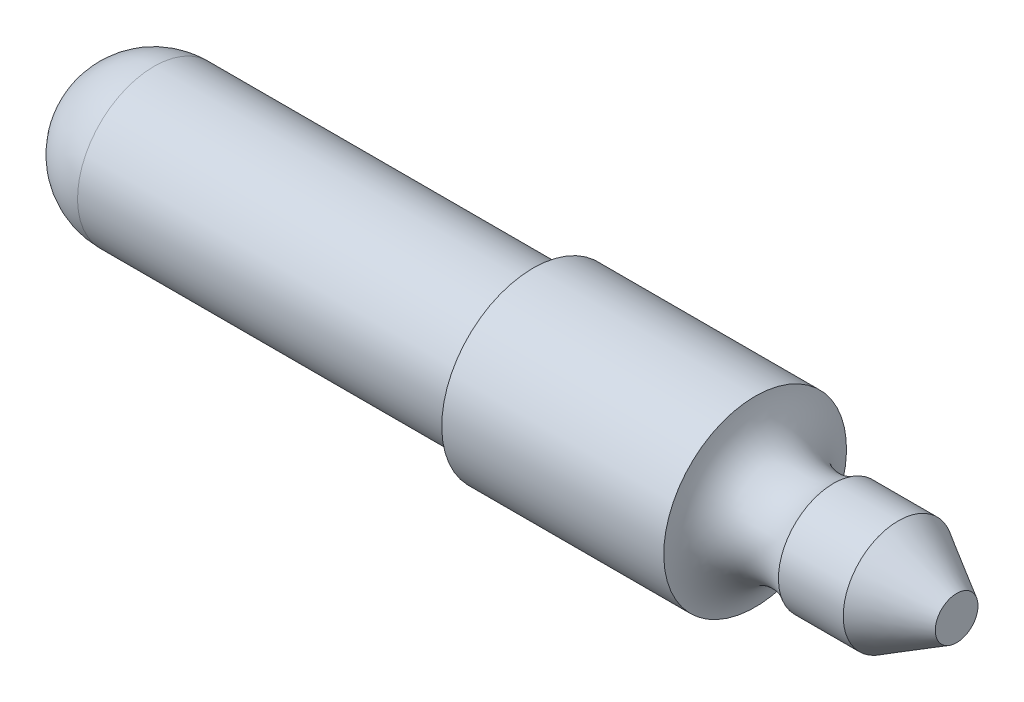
ISO-10303-21;
HEADER;
FILE_DESCRIPTION(('STEP AP214'),'2;1');
FILE_NAME('part.step','',(''),(''),'','','');
FILE_SCHEMA(('AUTOMOTIVE_DESIGN { 1 0 10303 214 1 1 1 1 }'));
ENDSEC;
DATA;
#1=APPLICATION_CONTEXT('core data for automotive mechanical design processes');
#2=APPLICATION_PROTOCOL_DEFINITION('international standard','automotive_design',2000,#1);
#3=PRODUCT_CONTEXT('',#1,'mechanical');
#4=PRODUCT('Part','Part','',(#3));
#5=PRODUCT_RELATED_PRODUCT_CATEGORY('part','',(#4));
#6=PRODUCT_DEFINITION_FORMATION('','',#4);
#7=PRODUCT_DEFINITION_CONTEXT('part definition',#1,'design');
#8=PRODUCT_DEFINITION('design','',#6,#7);
#9=PRODUCT_DEFINITION_SHAPE('','',#8);
#10=(LENGTH_UNIT() NAMED_UNIT(*) SI_UNIT(.MILLI.,.METRE.));
#11=(NAMED_UNIT(*) PLANE_ANGLE_UNIT() SI_UNIT($,.RADIAN.));
#12=(NAMED_UNIT(*) SI_UNIT($,.STERADIAN.) SOLID_ANGLE_UNIT());
#13=UNCERTAINTY_MEASURE_WITH_UNIT(LENGTH_MEASURE(1.E-05),#10,'distance_accuracy_value','');
#14=(GEOMETRIC_REPRESENTATION_CONTEXT(3) GLOBAL_UNCERTAINTY_ASSIGNED_CONTEXT((#13)) GLOBAL_UNIT_ASSIGNED_CONTEXT((#10,
#11,#12)) REPRESENTATION_CONTEXT('',''));
#15=CARTESIAN_POINT('',(0.,0.,0.));
#16=DIRECTION('',(0.,0.,1.));
#17=DIRECTION('',(1.,0.,0.));
#18=AXIS2_PLACEMENT_3D('',#15,#16,#17);
#19=CARTESIAN_POINT('',(0.,0.,0.));
#20=DIRECTION('',(1.,0.,0.));
#21=DIRECTION('',(0.,1.,0.));
#22=AXIS2_PLACEMENT_3D('',#19,#20,#21);
#23=PLANE('',#22);
#24=CARTESIAN_POINT('',(0.,0.,0.));
#25=DIRECTION('',(1.,0.,0.));
#26=DIRECTION('',(0.,1.,0.));
#27=AXIS2_PLACEMENT_3D('',#24,#25,#26);
#28=CIRCLE('',#27,0.318);
#29=CARTESIAN_POINT('',(0.,0.318,0.));
#30=VERTEX_POINT('',#29);
#31=EDGE_CURVE('E10',#30,#30,#28,.T.);
#32=ORIENTED_EDGE('',*,*,#31,.T.);
#33=EDGE_LOOP('',(#32));
#34=FACE_BOUND('',#33,.T.);
#35=ADVANCED_FACE('F28',(#34),#23,.T.);
#36=CARTESIAN_POINT('',(0.,0.,0.));
#37=DIRECTION('',(-1.,0.,0.));
#38=DIRECTION('',(0.,-1.,0.));
#39=AXIS2_PLACEMENT_3D('',#36,#37,#38);
#40=CONICAL_SURFACE('',#39,0.318,0.5235987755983);
#41=CARTESIAN_POINT('',(-0.867757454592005,0.,0.));
#42=DIRECTION('',(1.,0.,0.));
#43=DIRECTION('',(0.,1.,0.));
#44=AXIS2_PLACEMENT_3D('',#41,#42,#43);
#45=CIRCLE('',#44,0.819);
#46=CARTESIAN_POINT('',(-0.867757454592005,0.819,0.));
#47=VERTEX_POINT('',#46);
#48=EDGE_CURVE('E34',#47,#47,#45,.T.);
#49=ORIENTED_EDGE('',*,*,#48,.T.);
#50=EDGE_LOOP('',(#49));
#51=FACE_BOUND('',#50,.T.);
#52=ORIENTED_EDGE('',*,*,#31,.F.);
#53=EDGE_LOOP('',(#52));
#54=FACE_BOUND('',#53,.T.);
#55=ADVANCED_FACE('F69',(#51,#54),#40,.T.);
#56=CARTESIAN_POINT('',(0.,0.,0.));
#57=DIRECTION('',(1.,0.,0.));
#58=DIRECTION('',(0.,1.,0.));
#59=AXIS2_PLACEMENT_3D('',#56,#57,#58);
#60=CYLINDRICAL_SURFACE('',#59,0.819);
#61=CARTESIAN_POINT('',(-1.8313944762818,0.,0.));
#62=DIRECTION('',(1.,0.,0.));
#63=DIRECTION('',(0.,1.,0.));
#64=AXIS2_PLACEMENT_3D('',#61,#62,#63);
#65=CIRCLE('',#64,0.819);
#66=CARTESIAN_POINT('',(-1.8313944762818,0.818999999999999,0.));
#67=VERTEX_POINT('',#66);
#68=EDGE_CURVE('E38',#67,#67,#65,.T.);
#69=ORIENTED_EDGE('',*,*,#68,.T.);
#70=EDGE_LOOP('',(#69));
#71=FACE_BOUND('',#70,.T.);
#72=ORIENTED_EDGE('',*,*,#48,.F.);
#73=EDGE_LOOP('',(#72));
#74=FACE_BOUND('',#73,.T.);
#75=ADVANCED_FACE('F73',(#71,#74),#60,.T.);
#76=CARTESIAN_POINT('',(-2.24185762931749,0.,0.));
#77=DIRECTION('',(1.,0.,0.));
#78=DIRECTION('',(0.,1.,0.));
#79=AXIS2_PLACEMENT_3D('',#76,#77,#78);
#80=TOROIDAL_SURFACE('',#79,1.461,0.762);
#81=CARTESIAN_POINT('',(-2.997,0.,0.));
#82=DIRECTION('',(1.,0.,0.));
#83=DIRECTION('',(0.,1.,0.));
#84=AXIS2_PLACEMENT_3D('',#81,#82,#83);
#85=CIRCLE('',#84,1.359);
#86=CARTESIAN_POINT('',(-2.997,1.359,0.));
#87=VERTEX_POINT('',#86);
#88=EDGE_CURVE('E42',#87,#87,#85,.T.);
#89=ORIENTED_EDGE('',*,*,#88,.T.);
#90=EDGE_LOOP('',(#89));
#91=FACE_BOUND('',#90,.T.);
#92=ORIENTED_EDGE('',*,*,#68,.F.);
#93=EDGE_LOOP('',(#92));
#94=FACE_BOUND('',#93,.T.);
#95=ADVANCED_FACE('F77',(#91,#94),#80,.F.);
#96=CARTESIAN_POINT('',(0.,0.,0.));
#97=DIRECTION('',(1.,0.,0.));
#98=DIRECTION('',(0.,1.,0.));
#99=AXIS2_PLACEMENT_3D('',#96,#97,#98);
#100=CYLINDRICAL_SURFACE('',#99,1.359);
#101=CARTESIAN_POINT('',(-6.299,0.,0.));
#102=DIRECTION('',(1.,0.,0.));
#103=DIRECTION('',(0.,1.,0.));
#104=AXIS2_PLACEMENT_3D('',#101,#102,#103);
#105=CIRCLE('',#104,1.359);
#106=CARTESIAN_POINT('',(-6.299,1.359,0.));
#107=VERTEX_POINT('',#106);
#108=EDGE_CURVE('E47',#107,#107,#105,.T.);
#109=ORIENTED_EDGE('',*,*,#108,.T.);
#110=EDGE_LOOP('',(#109));
#111=FACE_BOUND('',#110,.T.);
#112=ORIENTED_EDGE('',*,*,#88,.F.);
#113=EDGE_LOOP('',(#112));
#114=FACE_BOUND('',#113,.T.);
#115=ADVANCED_FACE('F84',(#111,#114),#100,.T.);
#116=CARTESIAN_POINT('',(-6.299,1.137,0.));
#117=DIRECTION('',(-1.,0.,0.));
#118=DIRECTION('',(0.,-1.,0.));
#119=AXIS2_PLACEMENT_3D('',#116,#117,#118);
#120=PLANE('',#119);
#121=CARTESIAN_POINT('',(-6.299,0.,0.));
#122=DIRECTION('',(1.,0.,0.));
#123=DIRECTION('',(0.,1.,0.));
#124=AXIS2_PLACEMENT_3D('',#121,#122,#123);
#125=CIRCLE('',#124,1.137);
#126=CARTESIAN_POINT('',(-6.299,1.137,0.));
#127=VERTEX_POINT('',#126);
#128=EDGE_CURVE('E50',#127,#127,#125,.T.);
#129=ORIENTED_EDGE('',*,*,#128,.T.);
#130=EDGE_LOOP('',(#129));
#131=FACE_BOUND('',#130,.T.);
#132=ORIENTED_EDGE('',*,*,#108,.F.);
#133=EDGE_LOOP('',(#132));
#134=FACE_BOUND('',#133,.T.);
#135=ADVANCED_FACE('F66',(#131,#134),#120,.T.);
#136=CARTESIAN_POINT('',(0.,0.,0.));
#137=DIRECTION('',(1.,0.,0.));
#138=DIRECTION('',(0.,1.,0.));
#139=AXIS2_PLACEMENT_3D('',#136,#137,#138);
#140=CYLINDRICAL_SURFACE('',#139,1.137);
#141=CARTESIAN_POINT('',(-11.938,0.,0.));
#142=DIRECTION('',(1.,0.,0.));
#143=DIRECTION('',(0.,1.,0.));
#144=AXIS2_PLACEMENT_3D('',#141,#142,#143);
#145=CIRCLE('',#144,1.137);
#146=CARTESIAN_POINT('',(-11.938,1.137,0.));
#147=VERTEX_POINT('',#146);
#148=EDGE_CURVE('E53',#147,#147,#145,.T.);
#149=ORIENTED_EDGE('',*,*,#148,.T.);
#150=EDGE_LOOP('',(#149));
#151=FACE_BOUND('',#150,.T.);
#152=ORIENTED_EDGE('',*,*,#128,.F.);
#153=EDGE_LOOP('',(#152));
#154=FACE_BOUND('',#153,.T.);
#155=ADVANCED_FACE('F57',(#151,#154),#140,.T.);
#156=CARTESIAN_POINT('',(-11.938,0.,0.));
#157=DIRECTION('',(1.,0.,0.));
#158=DIRECTION('',(0.,1.,0.));
#159=AXIS2_PLACEMENT_3D('',#156,#157,#158);
#160=SPHERICAL_SURFACE('',#159,1.137);
#161=ORIENTED_EDGE('',*,*,#148,.F.);
#162=EDGE_LOOP('',(#161));
#163=FACE_BOUND('',#162,.T.);
#164=ADVANCED_FACE('F60',(#163),#160,.T.);
#165=CLOSED_SHELL('',(#35,#55,#75,#95,#115,#135,#155,#164));
#166=MANIFOLD_SOLID_BREP('B2',#165);
#167=ADVANCED_BREP_SHAPE_REPRESENTATION('',(#18,#166),#14);
#168=SHAPE_DEFINITION_REPRESENTATION(#9,#167);
ENDSEC;
END-ISO-10303-21;
